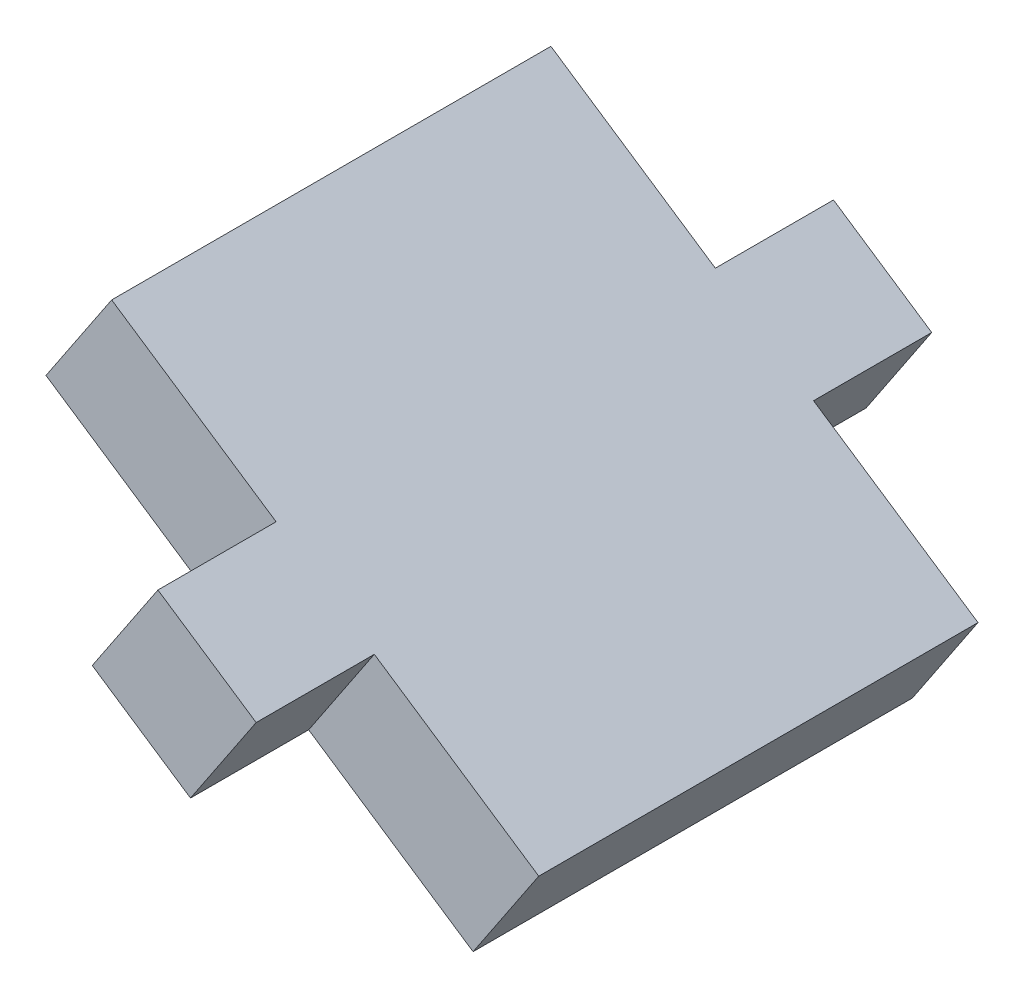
from build123d import *

# Parameters (mm, degrees)
BOSS_EXTRUDE1_DEPTH = 20.0152
BOSS_EXTRUDE2_DEPTH = 5.3848
BOSS_EXTRUDE3_DEPTH = 5.3848


with BuildPart() as part:
    # Sketch1 → Boss-Extrude1 (new body)
    with BuildSketch(Plane.XY):
        Polygon((-753.454952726, 320.574246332), (-733.99332561, 307.564438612), (-736.985908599, 303.087774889), (-756.447535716, 316.097582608), align=None)
    extrude(amount=-BOSS_EXTRUDE1_DEPTH)

    # Sketch2 → Boss-Extrude2 (add)
    with BuildSketch(Plane.XY):
        Polygon((-748.955053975, 311.088970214), (-744.478390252, 308.096387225), (-741.485807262, 312.573050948), (-745.962470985, 315.565633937), align=None)
    extrude(amount=BOSS_EXTRUDE2_DEPTH)

    # Sketch3 → Boss-Extrude3 (add)
    with BuildSketch(Plane(origin=(0, 0, -20.0152), x_dir=(-1, 0, 0), z_dir=(0, 0, -1))):
        Polygon((741.485807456, 312.573051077), (744.478390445, 308.096387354), (748.955054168, 311.088970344), (745.962471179, 315.565634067), align=None)
    extrude(amount=BOSS_EXTRUDE3_DEPTH)


solid = part.part
